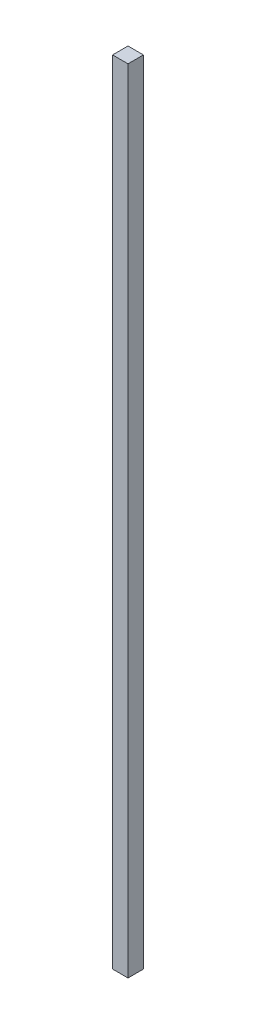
from build123d import *

# Parameters (mm, degrees)
SKETCH_1_W      = 60
SKETCH_1_H      = 60
EXTRUDE_1_DEPTH = 3080


with BuildPart() as part:
    # Sketch 1 → Extrude 1 (new body)
    with BuildSketch(Plane(origin=(0, 0, 0), x_dir=(1, 0, 0), z_dir=(0, 1, 0))):
        Rectangle(SKETCH_1_W, SKETCH_1_H)
    extrude(amount=EXTRUDE_1_DEPTH)


solid = part.part
